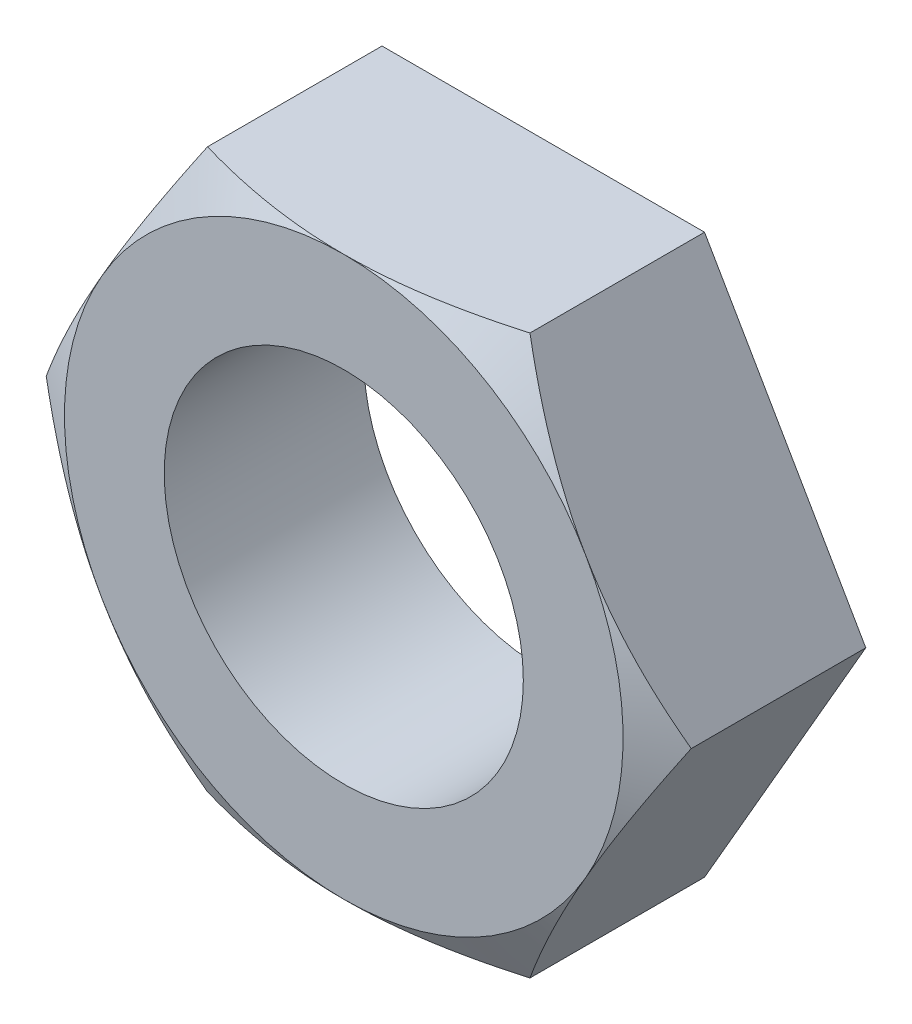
from build123d import *

# Parameters (mm, degrees)
SKETCH1_R          = 7.14375
BASE_EXTRUDE_DEPTH = 7.9375


with BuildPart() as part:
    # Sketch1 → Base-Extrude (new body)
    with BuildSketch(Plane.XY):
        Polygon((-6.415804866, 11.1125), (6.415804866, 11.1125), (12.831609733, 0), (6.415804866, -11.1125), (-6.415804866, -11.1125), (-12.831609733, 0), align=None)
        Circle(SKETCH1_R, mode=Mode.SUBTRACT)
    extrude(amount=BASE_EXTRUDE_DEPTH)

    # Sketch3 → Cut-Revolve2 (revolve, cut)
    with BuildSketch(Plane(origin=(0, 0, 0), x_dir=(1, 0, 0), z_dir=(0, 1, 0))):
        Polygon((-11.1125, -7.9375), (-12.831609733, -7.9375), (-12.831609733, -6.944971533), align=None)
    revolve(axis=Axis((0, 0, 5.08), (0, 0, -1)), mode=Mode.SUBTRACT)


solid = part.part
